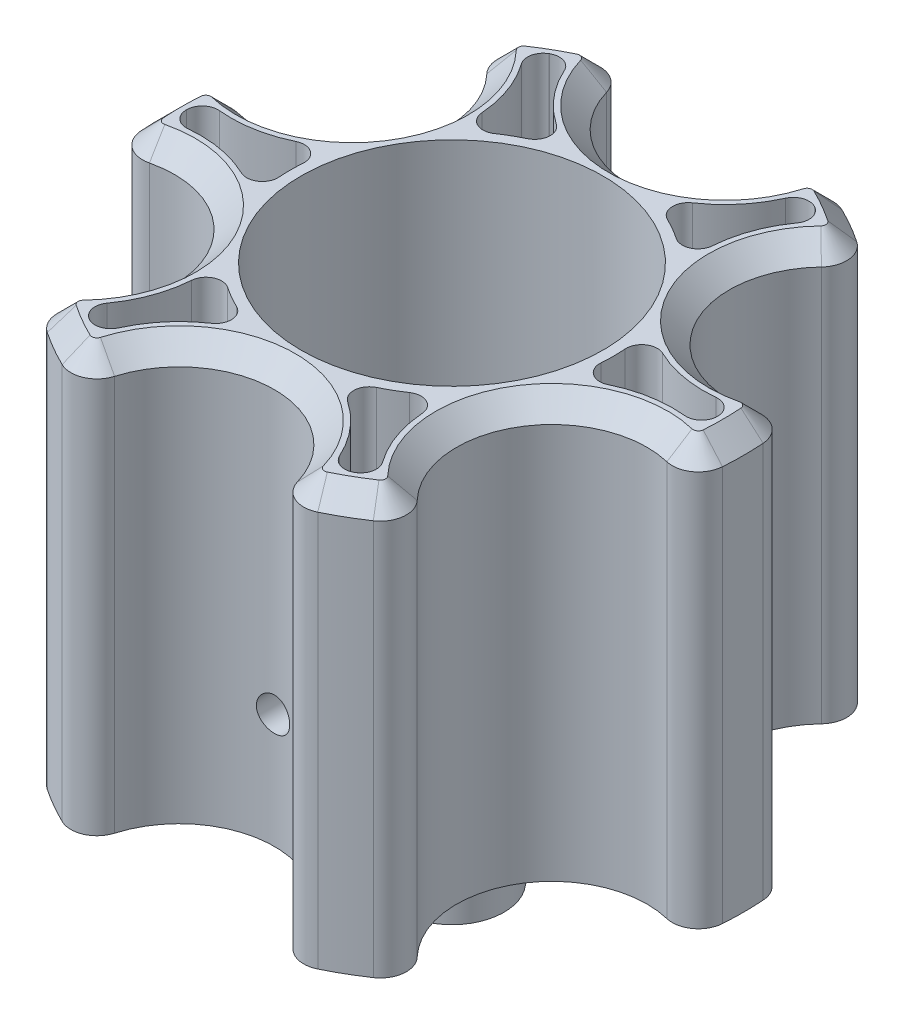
from build123d import *

# Parameters (mm, degrees)
EXTRUDE_1_DEPTH     = 40
FILLET_1_R          = 2.5
CHAMFER_1_SIZE      = 2
SKETCH_2_R          = 14.5
CUT_EXTRUDE_1_DEPTH = 38
SKETCH_3_R          = 6
SKETCH_3_R_2        = 3
EXTRUDE_2_DEPTH     = 13.5
SKETCH_4_R          = 1.6
CUT_EXTRUDE_2_DEPTH = 12
SKETCH_5_R          = 1.25
CUT_EXTRUDE_3_DEPTH = 25
CUT_EXTRUDE_START   = -10
SKETCH_6_R          = 3
CUT_EXTRUDE_4_DEPTH = 50
EXTRUDE_START       = 11.5
SKETCH_7_R          = 5
SKETCH_7_R_2        = 3
EXTRUDE_3_DEPTH     = 11.5
EXTRUDE_START_2     = 1
SKETCH_8_R          = 6
SKETCH_8_R_2        = 5
EXTRUDE_4_DEPTH     = 1
CUT_EXTRUDE_START_2 = -1
SKETCH_9_R          = 6
CUT_EXTRUDE_5_DEPTH = 1
SKETCH_12_R         = 1.6
CUT_EXTRUDE_7_DEPTH = 8
CUT_EXTRUDE_START_3 = 20
SKETCH_13_R         = 1.6
CUT_EXTRUDE_8_DEPTH = 8
CUT_EXTRUDE_9_DEPTH = 38.5
FILLET_4_R          = 1.5


with BuildPart() as part:
    # Sketch 1 → Extrude 1 (new body)
    with BuildSketch(Plane(origin=(0, 0, 0), x_dir=(1, 0, 0), z_dir=(0, 1, 0))):
        with BuildLine():
            ThreePointArc((-27.491655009, 5.311205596), (-28, 0), (-27.491655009, -5.311205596))
            ThreePointArc((-27.491655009, -5.311205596), (-14.765733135, -8.525), (-18.345466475, -21.152868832))
            ThreePointArc((-18.345466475, -21.152868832), (-14, -24.248711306), (-9.146188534, -26.464074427))
            ThreePointArc((-9.146188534, -26.464074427), (0, -17.05), (9.146188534, -26.464074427))
            ThreePointArc((9.146188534, -26.464074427), (14, -24.248711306), (18.345466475, -21.152868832))
            ThreePointArc((18.345466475, -21.152868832), (14.765733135, -8.525), (27.491655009, -5.311205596))
            ThreePointArc((27.491655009, -5.311205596), (28, 0), (27.491655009, 5.311205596))
            ThreePointArc((27.491655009, 5.311205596), (14.765733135, 8.525), (18.345466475, 21.152868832))
            ThreePointArc((18.345466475, 21.152868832), (14, 24.248711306), (9.146188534, 26.464074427))
            ThreePointArc((9.146188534, 26.464074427), (0, 17.05), (-9.146188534, 26.464074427))
            ThreePointArc((-9.146188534, 26.464074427), (-14, 24.248711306), (-18.345466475, 21.152868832))
            ThreePointArc((-18.345466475, 21.152868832), (-14.765733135, 8.525), (-27.491655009, 5.311205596))
        make_face()
    extrude(amount=EXTRUDE_1_DEPTH)

    # Fillet 1
    fillet_1_edges = [part.edges().sort_by_distance(p)[0] for p in [
        (27.491655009, 20, 5.311205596),
        (18.345466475, 20, 21.152868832),
        (9.146188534, 20, 26.464074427),
        (-9.146188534, 20, 26.464074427),
        (-18.345466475, 20, 21.152868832),
        (-27.491655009, 20, 5.311205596),
        (-27.491655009, 20, -5.311205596),
        (-18.345466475, 20, -21.152868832),
        (-9.146188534, 20, -26.464074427),
        (9.146188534, 20, -26.464074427),
        (18.345466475, 20, -21.152868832),
        (27.491655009, 20, -5.311205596),
    ]]
    fillet(fillet_1_edges, radius=FILLET_1_R)

    # Chamfer 1
    chamfer_1_edges = [part.edges().sort_by_distance(p)[0] for p in [
        (28, 40, 0),
        (14.765733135, 40, 8.525),
        (14.765733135, 40, -8.525),
        (14, 40, -24.248711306),
        (0, 40, -17.05),
        (-14, 40, -24.248711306),
        (-14.765733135, 40, -8.525),
        (-28, 40, 0),
        (-14.765733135, 40, 8.525),
        (-14, 40, 24.248711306),
        (0, 40, 17.05),
        (14, 40, 24.248711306),
        (-10.168776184, 40, 25.20624322),
        (-16.744858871, 40, 21.409540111),
        (26.913635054, 40, -3.79670311),
        (16.744858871, 40, -21.409540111),
        (10.168776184, 40, -25.20624322),
        (-10.168776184, 40, -25.20624322),
        (-16.744858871, 40, -21.409540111),
        (-26.913635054, 40, -3.79670311),
        (-26.913635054, 40, 3.79670311),
        (10.168776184, 40, 25.20624322),
        (16.744858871, 40, 21.409540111),
        (26.913635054, 40, 3.79670311),
    ]]
    chamfer(chamfer_1_edges, length=CHAMFER_1_SIZE)

    # Sketch 2 → Cut-Extrude 1 (cut)
    with BuildSketch(Plane(origin=(0, 40, 0), x_dir=(1, 0, 0), z_dir=(0, 1, 0))):
        with Locations(Location((0, 0, 0), (0, 0, 270))):
            Circle(SKETCH_2_R)
    extrude(amount=-CUT_EXTRUDE_1_DEPTH, mode=Mode.SUBTRACT)

    # Sketch 3 → Extrude 2 (add)
    with BuildSketch(Plane(origin=(0, 2, 0), x_dir=(1, 0, 0), z_dir=(0, 1, 0))):
        with Locations(Location((0, 0, 0), (0, 0, 270))):
            Circle(SKETCH_3_R)
        with Locations(Location((0, 0, 0), (0, 0, 270))):
            Circle(SKETCH_3_R_2, mode=Mode.SUBTRACT)
    extrude(amount=EXTRUDE_2_DEPTH)

    # Sketch 4 → Cut-Extrude 2 (cut)
    with BuildSketch(Plane.XZ):
        with Locations(Location((0, 0, 0), (0, 0, 270))):
            Circle(SKETCH_4_R)
    extrude(amount=-CUT_EXTRUDE_2_DEPTH, mode=Mode.SUBTRACT)

    # Sketch 5 → Cut-Extrude 3 (cut, symmetric)
    with BuildSketch(Plane.XY):
        with Locations((0, 11)):
            Circle(SKETCH_5_R)
    extrude(amount=CUT_EXTRUDE_3_DEPTH, both=True, mode=Mode.SUBTRACT)

    # Sketch 6 → Cut-Extrude 4 (cut)
    with BuildSketch(Plane.XY.offset(CUT_EXTRUDE_START)):
        with Locations((0, 11)):
            Circle(SKETCH_6_R)
    extrude(amount=-CUT_EXTRUDE_4_DEPTH, mode=Mode.SUBTRACT)

    # Sketch 7 → Extrude 3 (add)
    with BuildSketch(Plane.XZ.offset(EXTRUDE_START)):
        with Locations(Location((0, 0, 0), (0, 0, 90))):
            Circle(SKETCH_7_R)
        with Locations(Location((0, 0, 0), (0, 0, 90))):
            Circle(SKETCH_7_R_2, mode=Mode.SUBTRACT)
    extrude(amount=-EXTRUDE_3_DEPTH)

    # Sketch 8 → Extrude 4 (add)
    with BuildSketch(Plane.XZ.offset(EXTRUDE_START_2)):
        with Locations(Location((0, 0, 0), (0, 0, 90))):
            Circle(SKETCH_8_R)
        with Locations(Location((0, 0, 0), (0, 0, 270))):
            Circle(SKETCH_8_R_2, mode=Mode.SUBTRACT)
    extrude(amount=-EXTRUDE_4_DEPTH)

    # Sketch 9 → Cut-Extrude 5 (cut)
    with BuildSketch(Plane(origin=(0, 15.5, 0), x_dir=(1, 0, 0), z_dir=(0, 1, 0)).offset(CUT_EXTRUDE_START_2)):
        with Locations(Location((0, 0, 0), (0, 0, 270))):
            Circle(SKETCH_9_R)
    extrude(amount=CUT_EXTRUDE_5_DEPTH, mode=Mode.SUBTRACT)

    # Sketch 12 → Cut-Extrude 7 (cut)
    with BuildSketch(Plane.XY):
        with Locations(Location((0, 11, 0), (0, 0, 90))):
            Circle(SKETCH_12_R)
    extrude(amount=-CUT_EXTRUDE_7_DEPTH, mode=Mode.SUBTRACT)

    # Sketch 13 → Cut-Extrude 8 (cut)
    with BuildSketch(Plane.XY.offset(CUT_EXTRUDE_START_3)):
        with Locations(Location((0, 11, 0), (0, 0, 90))):
            Circle(SKETCH_13_R)
    extrude(amount=-CUT_EXTRUDE_8_DEPTH, mode=Mode.SUBTRACT)

    # Sketch 14 → Cut-Extrude 9 (cut)
    with BuildSketch(Plane(origin=(0, 40, 0), x_dir=(1, 0, 0), z_dir=(0, 1, 0))):
        with BuildLine():
            ThreePointArc((15.5, 0), (15.33233072, -2.273683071), (14.83295036, -4.498175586))
            ThreePointArc((14.83295036, -4.498175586), (19.796074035, -1.815122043), (25.437886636, -1.778742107))
            ThreePointArc((25.437886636, -1.778742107), (25.5, 0), (25.437886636, 1.778742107))
            ThreePointArc((25.437886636, 1.778742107), (19.796074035, 1.815122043), (14.83295036, 4.498175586))
            ThreePointArc((14.83295036, 4.498175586), (15.33233072, 2.273683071), (15.5, 0))
        make_face()
        with BuildLine():
            ThreePointArc((3.520940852, 15.094799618), (7.75, 13.423393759), (11.312009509, 10.596624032))
            ThreePointArc((11.312009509, 10.596624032), (11.469978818, 16.236341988), (14.25937917, 21.140484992))
            ThreePointArc((14.25937917, 21.140484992), (12.75, 22.083647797), (11.178507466, 22.919227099))
            ThreePointArc((11.178507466, 22.919227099), (8.326095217, 18.051464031), (3.520940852, 15.094799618))
        make_face()
        with BuildLine():
            ThreePointArc((-14.25937917, 21.140484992), (-11.469978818, 16.236341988), (-11.312009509, 10.596624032))
            ThreePointArc((-11.312009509, 10.596624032), (-7.75, 13.423393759), (-3.520940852, 15.094799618))
            ThreePointArc((-3.520940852, 15.094799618), (-8.326095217, 18.051464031), (-11.178507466, 22.919227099))
            ThreePointArc((-11.178507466, 22.919227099), (-12.75, 22.083647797), (-14.25937917, 21.140484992))
        make_face()
        with BuildLine():
            ThreePointArc((-25.437886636, -1.778742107), (-19.796074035, -1.815122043), (-14.83295036, -4.498175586))
            ThreePointArc((-14.83295036, -4.498175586), (-15.5, 0), (-14.83295036, 4.498175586))
            ThreePointArc((-14.83295036, 4.498175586), (-19.796074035, 1.815122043), (-25.437886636, 1.778742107))
            ThreePointArc((-25.437886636, 1.778742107), (-25.5, 0), (-25.437886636, -1.778742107))
        make_face()
        with BuildLine():
            ThreePointArc((-11.178507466, -22.919227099), (-8.326095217, -18.051464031), (-3.520940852, -15.094799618))
            ThreePointArc((-3.520940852, -15.094799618), (-7.75, -13.423393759), (-11.312009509, -10.596624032))
            ThreePointArc((-11.312009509, -10.596624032), (-11.469978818, -16.236341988), (-14.25937917, -21.140484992))
            ThreePointArc((-14.25937917, -21.140484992), (-12.75, -22.083647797), (-11.178507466, -22.919227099))
        make_face()
        with BuildLine():
            ThreePointArc((3.520940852, -15.094799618), (8.326095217, -18.051464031), (11.178507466, -22.919227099))
            ThreePointArc((11.178507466, -22.919227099), (12.75, -22.083647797), (14.25937917, -21.140484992))
            ThreePointArc((14.25937917, -21.140484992), (11.469978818, -16.236341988), (11.312009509, -10.596624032))
            ThreePointArc((11.312009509, -10.596624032), (7.75, -13.423393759), (3.520940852, -15.094799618))
        make_face()
    extrude(amount=-CUT_EXTRUDE_9_DEPTH, mode=Mode.SUBTRACT)

    # Fillet 4
    fillet_4_edges = [part.edges().sort_by_distance(p)[0] for p in [
        (25.437886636, 20.75, 1.778742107),
        (25.437886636, 20.75, -1.778742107),
        (14.83295036, 20.75, -4.498175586),
        (14.83295036, 20.75, 4.498175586),
        (14.25937917, 20.75, -21.140484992),
        (11.178507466, 20.75, -22.919227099),
        (3.520940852, 20.75, -15.094799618),
        (11.312009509, 20.75, -10.596624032),
        (-11.178507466, 20.75, -22.919227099),
        (-14.25937917, 20.75, -21.140484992),
        (-11.312009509, 20.75, -10.596624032),
        (-3.520940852, 20.75, -15.094799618),
        (-25.437886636, 20.75, -1.778742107),
        (-25.437886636, 20.75, 1.778742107),
        (-14.83295036, 20.75, 4.498175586),
        (-14.83295036, 20.75, -4.498175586),
        (-14.25937917, 20.75, 21.140484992),
        (-11.178507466, 20.75, 22.919227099),
        (-3.520940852, 20.75, 15.094799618),
        (-11.312009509, 20.75, 10.596624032),
        (11.178507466, 20.75, 22.919227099),
        (14.25937917, 20.75, 21.140484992),
        (11.312009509, 20.75, 10.596624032),
        (3.520940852, 20.75, 15.094799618),
    ]]
    fillet(fillet_4_edges, radius=FILLET_4_R)


solid = part.part
